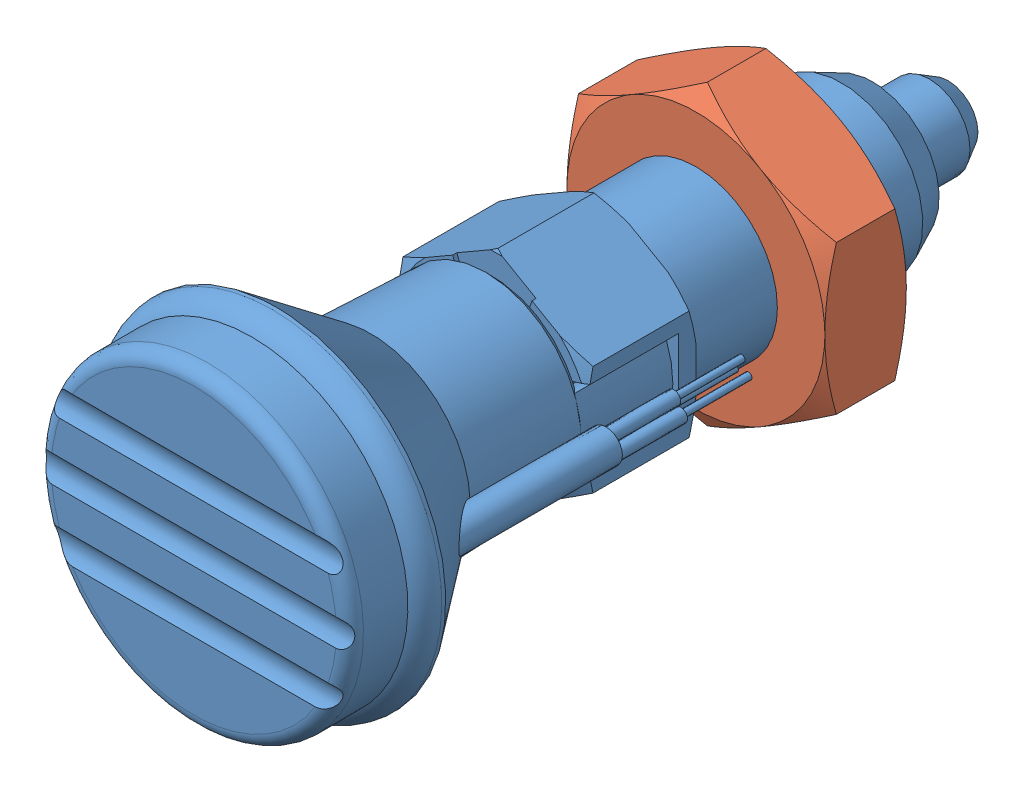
SolidWorks assembly NDX12LW-S.sldasm, configuration Default (file format 15000). Lengths in mm.
Overall size (25.96 25.96 56.01).
2 component instances, 2 part files, 0 mates.
Components (placement in the parent):
- NDX12LW-S_01-1: NDX12LW-S_01.sldprt [ﾃﾞﾌｫﾙﾄ] at origin size (25 25 56.01)
- NDX12LW-S_02-1: NDX12LW-S_02.sldprt [ﾃﾞﾌｫﾙﾄ] at origin size (25.96 25.96 6.01)
